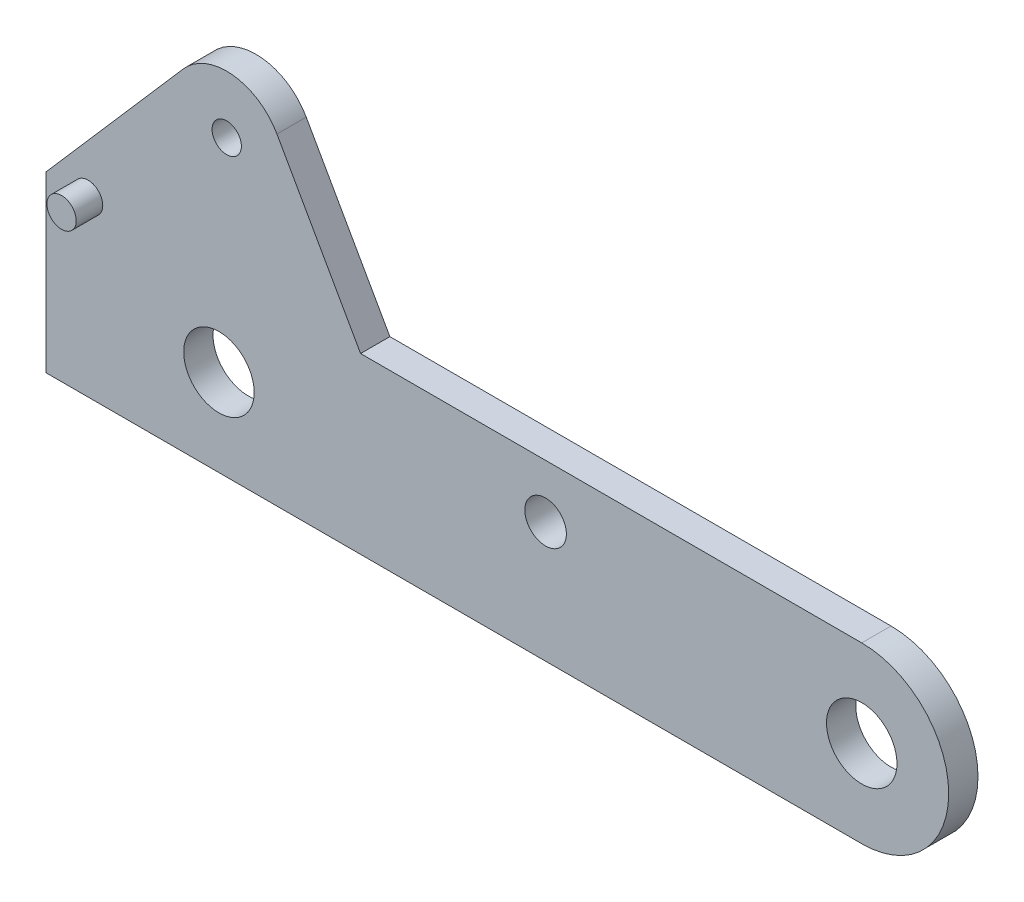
from build123d import *

# Parameters (mm, degrees)
ESQUISSE1_R        = 1.925
ESQUISSE1_R_2      = 0.8
ESQUISSE1_R_3      = 1.135
BOSS_EXTRU_1_DEPTH = 0.8
ESQUISSE2_R        = 0.8
BOSS_EXTRU_2_DEPTH = 2.25


with BuildPart() as part:
    # Esquisse1 → Boss.-Extru.1 (new, symmetric)
    with BuildSketch(Plane.XY):
        with BuildLine():
            Line((0, 0), (0, 9.5))
            Line((0, 9.5), (7.492445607, 18.116884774))
            ThreePointArc((7.492445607, 18.116884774), (10.187443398, 19.183915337), (12.613250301, 17.597400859))
            Line((12.613250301, 17.597400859), (17.18, 9.5))
            Line((17.18, 9.5), (44.55, 9.5))
            ThreePointArc((44.55, 9.5), (49.3, 4.75), (44.55, 0))
            Line((44.55, 0), (0, 0))
        make_face()
        with Locations((44.55, 4.75)):
            Circle(ESQUISSE1_R, mode=Mode.SUBTRACT)
        with Locations((9.445, 4.75)):
            Circle(ESQUISSE1_R, mode=Mode.SUBTRACT)
        with Locations((9.869520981, 16.05)):
            Circle(ESQUISSE1_R_2, mode=Mode.SUBTRACT)
        with Locations((2.3, 9.46)):
            Circle(ESQUISSE1_R_2, mode=Mode.SUBTRACT)
        with Locations((27.285, 6.585)):
            Circle(ESQUISSE1_R_3, mode=Mode.SUBTRACT)
    extrude(amount=BOSS_EXTRU_1_DEPTH, both=True)

    # Esquisse2 → Boss.-Extru.2 (add, symmetric)
    with BuildSketch(Plane.XY):
        with Locations((2.3, 9.46)):
            Circle(ESQUISSE2_R)
    extrude(amount=BOSS_EXTRU_2_DEPTH, both=True)


solid = part.part
